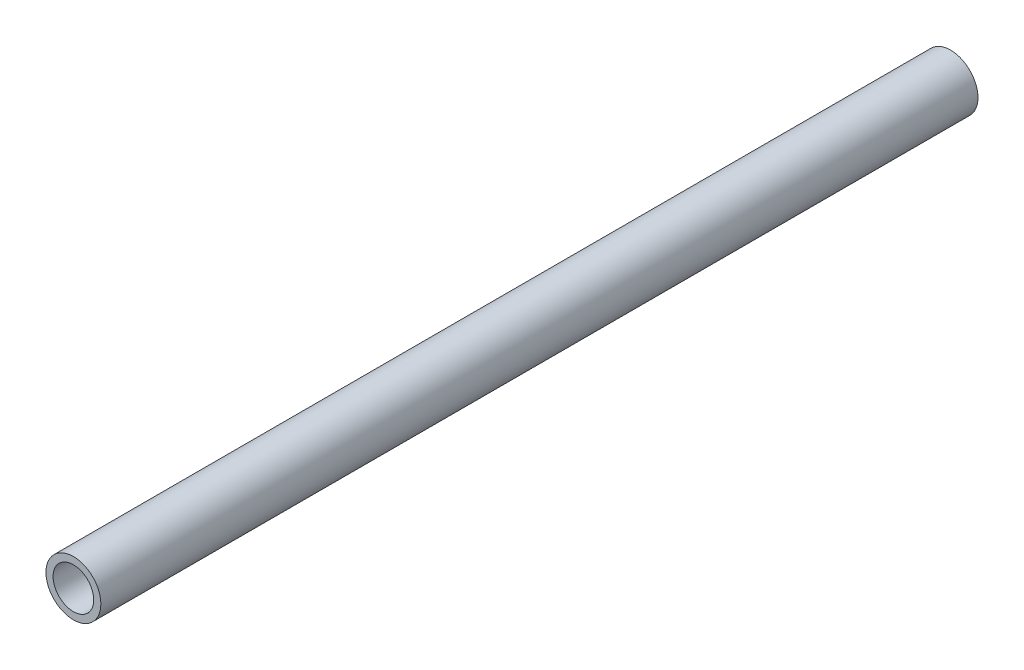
ISO-10303-21;
HEADER;
FILE_DESCRIPTION(('STEP AP214'),'2;1');
FILE_NAME('part.step','',(''),(''),'','','');
FILE_SCHEMA(('AUTOMOTIVE_DESIGN { 1 0 10303 214 1 1 1 1 }'));
ENDSEC;
DATA;
#1=APPLICATION_CONTEXT('core data for automotive mechanical design processes');
#2=APPLICATION_PROTOCOL_DEFINITION('international standard','automotive_design',2000,#1);
#3=PRODUCT_CONTEXT('',#1,'mechanical');
#4=PRODUCT('Part','Part','',(#3));
#5=PRODUCT_RELATED_PRODUCT_CATEGORY('part','',(#4));
#6=PRODUCT_DEFINITION_FORMATION('','',#4);
#7=PRODUCT_DEFINITION_CONTEXT('part definition',#1,'design');
#8=PRODUCT_DEFINITION('design','',#6,#7);
#9=PRODUCT_DEFINITION_SHAPE('','',#8);
#10=(LENGTH_UNIT() NAMED_UNIT(*) SI_UNIT(.MILLI.,.METRE.));
#11=(NAMED_UNIT(*) PLANE_ANGLE_UNIT() SI_UNIT($,.RADIAN.));
#12=(NAMED_UNIT(*) SI_UNIT($,.STERADIAN.) SOLID_ANGLE_UNIT());
#13=UNCERTAINTY_MEASURE_WITH_UNIT(LENGTH_MEASURE(1.E-05),#10,'distance_accuracy_value','');
#14=(GEOMETRIC_REPRESENTATION_CONTEXT(3) GLOBAL_UNCERTAINTY_ASSIGNED_CONTEXT((#13)) GLOBAL_UNIT_ASSIGNED_CONTEXT((#10,
#11,#12)) REPRESENTATION_CONTEXT('',''));
#15=CARTESIAN_POINT('',(0.,0.,0.));
#16=DIRECTION('',(0.,0.,1.));
#17=DIRECTION('',(1.,0.,0.));
#18=AXIS2_PLACEMENT_3D('',#15,#16,#17);
#19=CARTESIAN_POINT('',(0.,0.,340.921003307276));
#20=DIRECTION('',(0.,0.,1.));
#21=DIRECTION('',(1.,0.,0.));
#22=AXIS2_PLACEMENT_3D('',#19,#20,#21);
#23=PLANE('',#22);
#24=CARTESIAN_POINT('',(0.,0.,340.921003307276));
#25=DIRECTION('',(0.,0.,1.));
#26=DIRECTION('',(1.,0.,0.));
#27=AXIS2_PLACEMENT_3D('',#24,#25,#26);
#28=CIRCLE('',#27,10.668);
#29=CARTESIAN_POINT('',(10.668,0.,340.921003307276));
#30=VERTEX_POINT('',#29);
#31=EDGE_CURVE('E10',#30,#30,#28,.T.);
#32=ORIENTED_EDGE('',*,*,#31,.T.);
#33=EDGE_LOOP('',(#32));
#34=FACE_BOUND('',#33,.T.);
#35=CARTESIAN_POINT('',(0.,0.,340.921003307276));
#36=DIRECTION('',(0.,0.,1.));
#37=DIRECTION('',(1.,0.,0.));
#38=AXIS2_PLACEMENT_3D('',#35,#36,#37);
#39=CIRCLE('',#38,7.8994);
#40=CARTESIAN_POINT('',(7.8994,0.,340.921003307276));
#41=VERTEX_POINT('',#40);
#42=EDGE_CURVE('E39',#41,#41,#39,.T.);
#43=ORIENTED_EDGE('',*,*,#42,.F.);
#44=EDGE_LOOP('',(#43));
#45=FACE_BOUND('',#44,.T.);
#46=ADVANCED_FACE('F28',(#34,#45),#23,.T.);
#47=CARTESIAN_POINT('',(0.,0.,0.));
#48=DIRECTION('',(0.,0.,1.));
#49=DIRECTION('',(1.,0.,0.));
#50=AXIS2_PLACEMENT_3D('',#47,#48,#49);
#51=PLANE('',#50);
#52=CARTESIAN_POINT('',(0.,0.,0.));
#53=DIRECTION('',(0.,0.,1.));
#54=DIRECTION('',(1.,0.,0.));
#55=AXIS2_PLACEMENT_3D('',#52,#53,#54);
#56=CIRCLE('',#55,10.668);
#57=CARTESIAN_POINT('',(10.668,0.,0.));
#58=VERTEX_POINT('',#57);
#59=EDGE_CURVE('E32',#58,#58,#56,.T.);
#60=ORIENTED_EDGE('',*,*,#59,.F.);
#61=EDGE_LOOP('',(#60));
#62=FACE_BOUND('',#61,.T.);
#63=CARTESIAN_POINT('',(0.,0.,0.));
#64=DIRECTION('',(0.,0.,1.));
#65=DIRECTION('',(1.,0.,0.));
#66=AXIS2_PLACEMENT_3D('',#63,#64,#65);
#67=CIRCLE('',#66,7.8994);
#68=CARTESIAN_POINT('',(7.8994,0.,0.));
#69=VERTEX_POINT('',#68);
#70=EDGE_CURVE('E41',#69,#69,#67,.T.);
#71=ORIENTED_EDGE('',*,*,#70,.T.);
#72=EDGE_LOOP('',(#71));
#73=FACE_BOUND('',#72,.T.);
#74=ADVANCED_FACE('F51',(#62,#73),#51,.F.);
#75=CARTESIAN_POINT('',(0.,0.,340.921003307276));
#76=DIRECTION('',(0.,0.,-1.));
#77=DIRECTION('',(-1.,0.,0.));
#78=AXIS2_PLACEMENT_3D('',#75,#76,#77);
#79=CYLINDRICAL_SURFACE('',#78,10.668);
#80=ORIENTED_EDGE('',*,*,#31,.F.);
#81=EDGE_LOOP('',(#80));
#82=FACE_BOUND('',#81,.T.);
#83=ORIENTED_EDGE('',*,*,#59,.T.);
#84=EDGE_LOOP('',(#83));
#85=FACE_BOUND('',#84,.T.);
#86=ADVANCED_FACE('F30',(#82,#85),#79,.T.);
#87=CARTESIAN_POINT('',(0.,0.,340.921003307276));
#88=DIRECTION('',(0.,0.,-1.));
#89=DIRECTION('',(-1.,0.,0.));
#90=AXIS2_PLACEMENT_3D('',#87,#88,#89);
#91=CYLINDRICAL_SURFACE('',#90,7.8994);
#92=ORIENTED_EDGE('',*,*,#42,.T.);
#93=EDGE_LOOP('',(#92));
#94=FACE_BOUND('',#93,.T.);
#95=ORIENTED_EDGE('',*,*,#70,.F.);
#96=EDGE_LOOP('',(#95));
#97=FACE_BOUND('',#96,.T.);
#98=ADVANCED_FACE('F47',(#94,#97),#91,.F.);
#99=CLOSED_SHELL('',(#46,#74,#86,#98));
#100=MANIFOLD_SOLID_BREP('B2',#99);
#101=ADVANCED_BREP_SHAPE_REPRESENTATION('',(#18,#100),#14);
#102=SHAPE_DEFINITION_REPRESENTATION(#9,#101);
ENDSEC;
END-ISO-10303-21;
